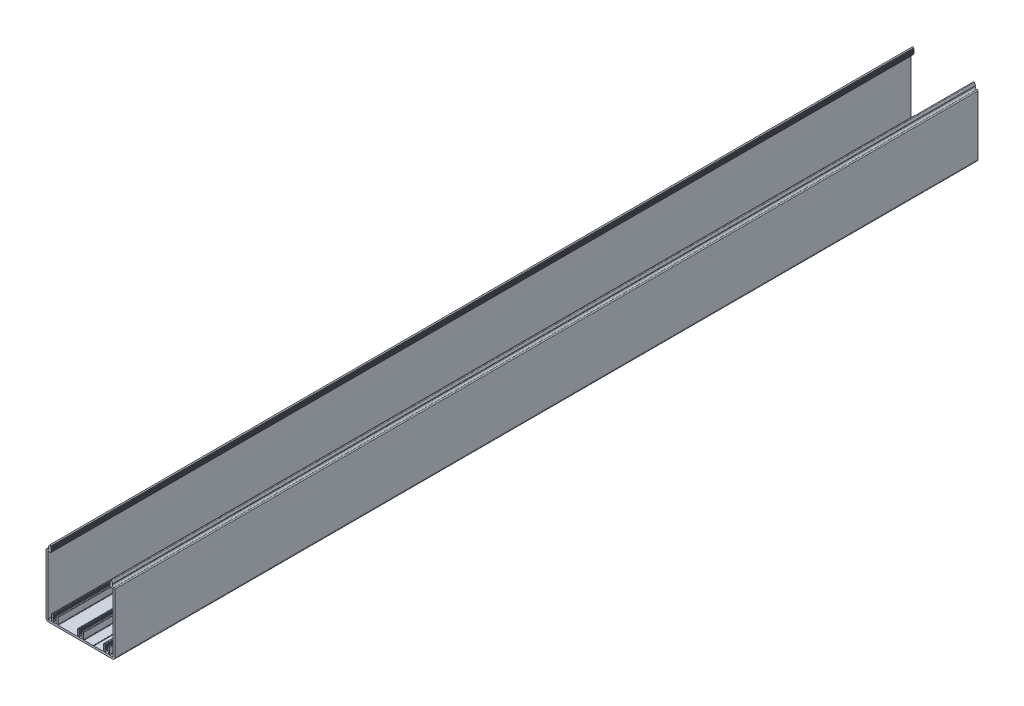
from build123d import *

# Parameters (mm, degrees)
AUFSATZ_LINEAR_AUSTRAGEN1_DEPTH = 1000


with BuildPart() as part:
    # Model → Aufsatz-Linear austragen1 (new body)
    with BuildSketch(Plane.XY):
        with BuildLine():
            Line((127.8017825, -53.135075), (128.3517825, -53.452617))
            Line((128.3517825, -53.452617), (128.3517825, -54.217531))
            Line((128.3517825, -54.217531), (127.8017825, -54.535075))
            Line((127.8017825, -54.535075), (128.3517825, -54.852617))
            Line((128.3517825, -54.852617), (128.3517825, -55.617531))
            Line((128.3517825, -55.617531), (127.8017825, -55.935075))
            Line((127.8017825, -55.935075), (128.3517825, -56.252615))
            Line((128.3517825, -56.252615), (128.3517825, -57.017521))
            Line((128.3517825, -57.017521), (127.8017825, -57.335065))
            Line((127.8017825, -57.335065), (128.3517825, -57.652607))
            Line((128.3517825, -57.652607), (128.3517825, -58.417521))
            Line((128.3517825, -58.417521), (127.8017825, -58.735065))
            Line((127.8017825, -58.735065), (127.8017825, -60.285065))
            ThreePointArc((127.8017825, -60.285065), (127.948229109, -60.638618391), (128.3017825, -60.785065))
            Line((128.3017825, -60.785065), (131.6017685, -60.785065))
            ThreePointArc((131.6017685, -60.785065), (131.955321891, -60.638618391), (132.1017685, -60.285065))
            Line((132.1017685, -60.285065), (132.1017685, -59.435065))
            Line((132.1017685, -59.435065), (131.5517685, -59.117521))
            Line((131.5517685, -59.117521), (131.5517685, -58.352607))
            Line((131.5517685, -58.352607), (132.1017685, -58.035065))
            Line((132.1017685, -58.035065), (131.5517685, -57.717521))
            Line((131.5517685, -57.717521), (131.5517685, -56.952607))
            Line((131.5517685, -56.952607), (132.1017685, -56.635065))
            Line((132.1017685, -56.635065), (131.5517685, -56.317523))
            Line((131.5517685, -56.317523), (131.5517685, -55.552617))
            Line((131.5517685, -55.552617), (132.1017685, -55.235075))
            Line((132.1017685, -55.235075), (131.5517685, -54.917531))
            Line((131.5517685, -54.917531), (131.5517685, -54.152617))
            Line((131.5517685, -54.152617), (132.1017685, -53.835075))
            Line((132.1017685, -53.835075), (131.5517685, -53.517531))
            Line((131.5517685, -53.517531), (131.5517685, -53.285075))
            ThreePointArc((131.5517685, -53.285075), (131.698215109, -52.931521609), (132.0517685, -52.785075))
            Line((132.0517685, -52.785075), (133.1017685, -52.785075))
            ThreePointArc((133.1017685, -52.785075), (133.455321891, -52.931521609), (133.6017685, -53.285075))
            Line((133.6017685, -53.285075), (133.6017685, -60.285065))
            ThreePointArc((133.6017685, -60.285065), (133.748215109, -60.638618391), (134.1017685, -60.785065))
            Line((134.1017685, -60.785065), (144.6053625, -60.785063))
            ThreePointArc((144.6053625, -60.785063), (144.9517725, -60.438653), (145.2981825, -60.785063))
            Line((145.2981825, -60.785063), (155.8017745, -60.785063))
            ThreePointArc((155.8017745, -60.785063), (156.155327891, -60.638616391), (156.3017745, -60.285063))
            Line((156.3017745, -60.285063), (156.3017745, -53.285075))
            ThreePointArc((156.3017745, -53.285075), (156.448221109, -52.931521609), (156.8017745, -52.785075))
            Line((156.8017745, -52.785075), (157.8517745, -52.785075))
            ThreePointArc((157.8517745, -52.785075), (158.205327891, -52.931521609), (158.3517745, -53.285075))
            Line((158.3517745, -53.285075), (158.3517745, -53.517531))
            Line((158.3517745, -53.517531), (157.8017745, -53.835075))
            Line((157.8017745, -53.835075), (158.3517745, -54.152617))
            Line((158.3517745, -54.152617), (158.3517745, -54.917531))
            Line((158.3517745, -54.917531), (157.8017745, -55.235075))
            Line((157.8017745, -55.235075), (158.3517745, -55.552617))
            Line((158.3517745, -55.552617), (158.3517745, -56.317523))
            Line((158.3517745, -56.317523), (157.8017745, -56.635065))
            Line((157.8017745, -56.635065), (158.3517745, -56.952607))
            Line((158.3517745, -56.952607), (158.3517745, -57.717521))
            Line((158.3517745, -57.717521), (157.8017745, -58.035063))
            Line((157.8017745, -58.035063), (158.3517745, -58.352607))
            Line((158.3517745, -58.352607), (158.3517745, -59.117521))
            Line((158.3517745, -59.117521), (157.8017745, -59.435063))
            Line((157.8017745, -59.435063), (157.8017745, -60.285063))
            ThreePointArc((157.8017745, -60.285063), (157.948221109, -60.638616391), (158.3017745, -60.785063))
            Line((158.3017745, -60.785063), (161.6017645, -60.785063))
            ThreePointArc((161.6017645, -60.785063), (161.955317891, -60.638616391), (162.1017645, -60.285063))
            Line((162.1017645, -60.285063), (162.1017645, -58.735063))
            Line((162.1017645, -58.735063), (161.5517645, -58.417521))
            Line((161.5517645, -58.417521), (161.5517645, -57.652607))
            Line((161.5517645, -57.652607), (162.1017645, -57.335063))
            Line((162.1017645, -57.335063), (161.5517645, -57.017521))
            Line((161.5517645, -57.017521), (161.5517645, -56.252615))
            Line((161.5517645, -56.252615), (162.1017645, -55.935075))
            Line((162.1017645, -55.935075), (161.5517645, -55.617531))
            Line((161.5517645, -55.617531), (161.5517645, -54.852617))
            Line((161.5517645, -54.852617), (162.1017645, -54.535075))
            Line((162.1017645, -54.535075), (161.5517645, -54.217531))
            Line((161.5517645, -54.217531), (161.5517645, -53.452617))
            Line((161.5517645, -53.452617), (162.1017645, -53.135075))
            Line((162.1017645, -53.135075), (162.1017645, -52.785073))
            Line((162.1017645, -52.785073), (163.1017645, -52.785073))
            ThreePointArc((163.1017645, -52.785073), (163.455317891, -52.931519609), (163.6017645, -53.285073))
            Line((163.6017645, -53.285073), (163.6017645, -60.285061))
            ThreePointArc((163.6017645, -60.285061), (163.748211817, -60.638615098), (164.1017665, -60.785061))
            Line((164.1017665, -60.785061), (166.9517505, -60.785063))
            ThreePointArc((166.9517505, -60.785063), (167.44672654, -60.580038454), (167.6517525, -60.085063))
            Line((167.6517525, -60.085063), (167.6517825, 7.414933))
            ThreePointArc((167.6517825, 7.414933), (167.505335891, 7.768486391), (167.1517825, 7.914933))
            Line((167.1517825, 7.914933), (164.4528545, 7.914931))
            Line((164.4528545, 7.914931), (164.4527045, 8.364385))
            Line((164.4527045, 8.364385), (163.9017685, 8.682467))
            Line((163.9017685, 8.682467), (163.9017685, 9.447381))
            Line((163.9017685, 9.447381), (164.4517685, 9.764923))
            Line((164.4517685, 9.764923), (163.9017685, 10.082467))
            Line((163.9017685, 10.082467), (163.9017685, 10.847381))
            Line((163.9017685, 10.847381), (164.4517685, 11.164923))
            Line((164.4517685, 11.164923), (163.9017685, 11.482463))
            Line((163.9017685, 11.482463), (163.9017685, 12.247371))
            Line((163.9017685, 12.247371), (164.4517685, 12.564913))
            Line((164.4517685, 12.564913), (163.9017685, 12.882455))
            Line((163.9017685, 12.882455), (163.9017685, 13.647369))
            Line((163.9017685, 13.647369), (164.4584205, 13.968753))
            Line((164.4584205, 13.968753), (164.4584305, 14.463097))
            ThreePointArc((164.4584305, 14.463097), (165.015693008, 15.189318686), (165.8614005, 14.839007))
            Line((165.8614005, 14.839007), (167.0178105, 12.836045))
            ThreePointArc((167.0178105, 12.836045), (167.151544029, 12.313997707), (166.994930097, 11.798352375))
            ThreePointArc((166.994930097, 11.798352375), (166.942701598, 10.219716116), (168.3017985, 9.414933))
            Line((168.3017985, 9.414933), (168.9517805, 9.414935))
            ThreePointArc((168.9517805, 9.414935), (169.658889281, 9.122041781), (169.9517825, 8.414933))
            Line((169.9517825, 8.414933), (169.9517525, -60.085063))
            ThreePointArc((169.9517525, -60.085063), (169.073076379, -62.206379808), (166.9517625, -63.085063))
            Line((166.9517625, -63.085063), (92.9517765, -63.085063))
            ThreePointArc((92.9517765, -63.085063), (90.830454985, -62.206385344), (89.9517745, -60.085065))
            Line((89.9517745, -60.085065), (89.9517725, 8.414933))
            ThreePointArc((89.9517725, 8.414933), (90.244666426, 9.122040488), (90.9517745, 9.414933))
            Line((90.9517745, 9.414933), (91.6017565, 9.414933))
            ThreePointArc((91.6017565, 9.414933), (92.960857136, 10.219714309), (92.908629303, 11.798352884))
            ThreePointArc((92.908629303, 11.798352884), (92.752013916, 12.313996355), (92.8857445, 12.836043))
            Line((92.8857445, 12.836043), (94.0421545, 14.839003))
            ThreePointArc((94.0421545, 14.839003), (94.887861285, 15.189312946), (95.4451265, 14.463095))
            Line((95.4451265, 14.463095), (95.4451345, 13.968757))
            Line((95.4451345, 13.968757), (96.0017865, 13.647375))
            Line((96.0017865, 13.647375), (96.0017865, 12.882461))
            Line((96.0017865, 12.882461), (95.4517865, 12.564919))
            Line((95.4517865, 12.564919), (96.0017865, 12.247377))
            Line((96.0017865, 12.247377), (96.0017865, 11.482469))
            Line((96.0017865, 11.482469), (95.4517865, 11.164929))
            Line((95.4517865, 11.164929), (96.0017865, 10.847387))
            Line((96.0017865, 10.847387), (96.0017865, 10.082473))
            Line((96.0017865, 10.082473), (95.4517865, 9.764929))
            Line((95.4517865, 9.764929), (96.0017865, 9.447387))
            Line((96.0017865, 9.447387), (96.0017865, 8.682473))
            Line((96.0017865, 8.682473), (95.4508505, 8.364391))
            Line((95.4508505, 8.364391), (95.4506985, 7.914929))
            Line((95.4506985, 7.914929), (92.7517745, 7.914931))
            ThreePointArc((92.7517745, 7.914931), (92.398221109, 7.768484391), (92.2517745, 7.414931))
            Line((92.2517745, 7.414931), (92.2517725, -60.085065))
            ThreePointArc((92.2517725, -60.085065), (92.456797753, -60.580039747), (92.9517725, -60.785065))
            Line((92.9517725, -60.785065), (95.8017825, -60.785063))
            ThreePointArc((95.8017825, -60.785063), (96.155335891, -60.638616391), (96.3017825, -60.285063))
            Line((96.3017825, -60.285063), (96.3017825, -53.285075))
            ThreePointArc((96.3017825, -53.285075), (96.448229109, -52.931521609), (96.8017825, -52.785075))
            Line((96.8017825, -52.785075), (97.8017825, -52.785075))
            Line((97.8017825, -52.785075), (97.8017825, -53.135075))
            Line((97.8017825, -53.135075), (98.3517825, -53.452617))
            Line((98.3517825, -53.452617), (98.3517825, -54.217531))
            Line((98.3517825, -54.217531), (97.8017825, -54.535075))
            Line((97.8017825, -54.535075), (98.3517825, -54.852617))
            Line((98.3517825, -54.852617), (98.3517825, -55.617531))
            Line((98.3517825, -55.617531), (97.8017825, -55.935075))
            Line((97.8017825, -55.935075), (98.3517825, -56.252615))
            Line((98.3517825, -56.252615), (98.3517825, -57.017521))
            Line((98.3517825, -57.017521), (97.8017825, -57.335063))
            Line((97.8017825, -57.335063), (98.3517825, -57.652607))
            Line((98.3517825, -57.652607), (98.3517825, -58.417521))
            Line((98.3517825, -58.417521), (97.8017825, -58.735063))
            Line((97.8017825, -58.735063), (97.8017825, -60.285063))
            ThreePointArc((97.8017825, -60.285063), (97.948229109, -60.638616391), (98.3017825, -60.785063))
            Line((98.3017825, -60.785063), (101.6017725, -60.785063))
            ThreePointArc((101.6017725, -60.785063), (101.955325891, -60.638616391), (102.1017725, -60.285063))
            Line((102.1017725, -60.285063), (102.1017725, -59.435063))
            Line((102.1017725, -59.435063), (101.5517725, -59.117521))
            Line((101.5517725, -59.117521), (101.5517725, -58.352607))
            Line((101.5517725, -58.352607), (102.1017725, -58.035063))
            Line((102.1017725, -58.035063), (101.5517725, -57.717521))
            Line((101.5517725, -57.717521), (101.5517725, -56.952607))
            Line((101.5517725, -56.952607), (102.1017725, -56.635065))
            Line((102.1017725, -56.635065), (101.5517725, -56.317523))
            Line((101.5517725, -56.317523), (101.5517725, -55.552617))
            Line((101.5517725, -55.552617), (102.1017725, -55.235075))
            Line((102.1017725, -55.235075), (101.5517725, -54.917531))
            Line((101.5517725, -54.917531), (101.5517725, -54.152617))
            Line((101.5517725, -54.152617), (102.1017725, -53.835075))
            Line((102.1017725, -53.835075), (101.5517725, -53.517531))
            Line((101.5517725, -53.517531), (101.5517725, -53.285075))
            ThreePointArc((101.5517725, -53.285075), (101.698219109, -52.931521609), (102.0517725, -52.785075))
            Line((102.0517725, -52.785075), (103.1017725, -52.785075))
            ThreePointArc((103.1017725, -52.785075), (103.455325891, -52.931521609), (103.6017725, -53.285075))
            Line((103.6017725, -53.285075), (103.6017725, -60.285063))
            ThreePointArc((103.6017725, -60.285063), (103.748219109, -60.638616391), (104.1017725, -60.785063))
            Line((104.1017725, -60.785063), (125.8017805, -60.785065))
            ThreePointArc((125.8017805, -60.785065), (126.155335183, -60.638619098), (126.3017825, -60.285065))
            Line((126.3017825, -60.285065), (126.3017825, -53.285075))
            ThreePointArc((126.3017825, -53.285075), (126.448229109, -52.931521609), (126.8017825, -52.785075))
            Line((126.8017825, -52.785075), (127.8017825, -52.785075))
            Line((127.8017825, -52.785075), (127.8017825, -53.135075))
        make_face()
    extrude(amount=AUFSATZ_LINEAR_AUSTRAGEN1_DEPTH)


solid = part.part
